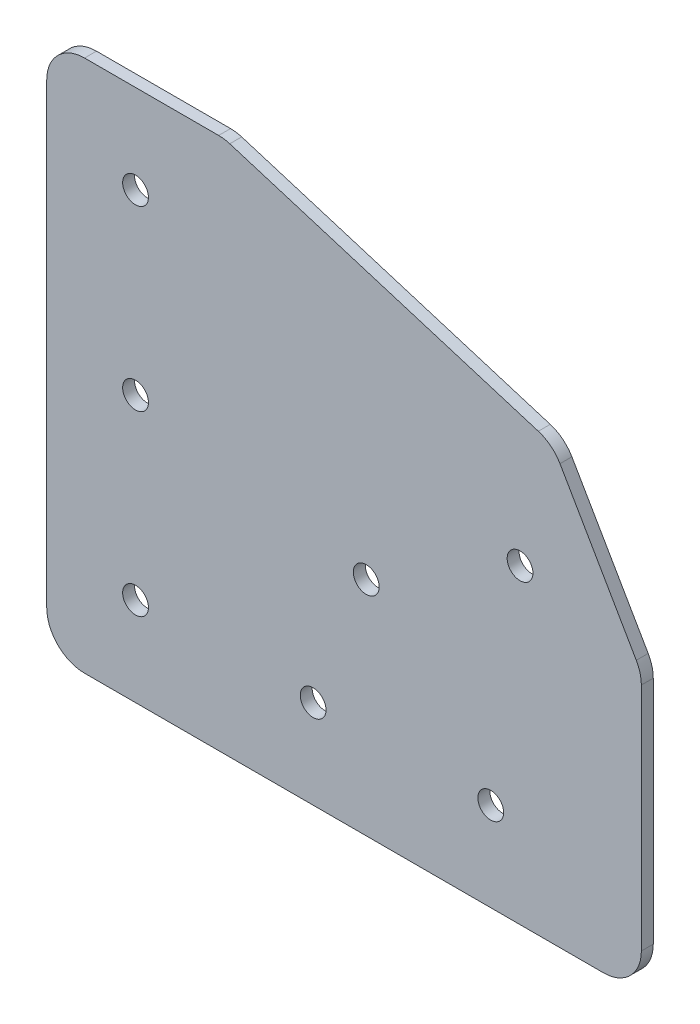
ISO-10303-21;
HEADER;
FILE_DESCRIPTION(('STEP AP214'),'2;1');
FILE_NAME('part.step','',(''),(''),'','','');
FILE_SCHEMA(('AUTOMOTIVE_DESIGN { 1 0 10303 214 1 1 1 1 }'));
ENDSEC;
DATA;
#1=APPLICATION_CONTEXT('core data for automotive mechanical design processes');
#2=APPLICATION_PROTOCOL_DEFINITION('international standard','automotive_design',2000,#1);
#3=PRODUCT_CONTEXT('',#1,'mechanical');
#4=PRODUCT('Part','Part','',(#3));
#5=PRODUCT_RELATED_PRODUCT_CATEGORY('part','',(#4));
#6=PRODUCT_DEFINITION_FORMATION('','',#4);
#7=PRODUCT_DEFINITION_CONTEXT('part definition',#1,'design');
#8=PRODUCT_DEFINITION('design','',#6,#7);
#9=PRODUCT_DEFINITION_SHAPE('','',#8);
#10=(LENGTH_UNIT() NAMED_UNIT(*) SI_UNIT(.MILLI.,.METRE.));
#11=(NAMED_UNIT(*) PLANE_ANGLE_UNIT() SI_UNIT($,.RADIAN.));
#12=(NAMED_UNIT(*) SI_UNIT($,.STERADIAN.) SOLID_ANGLE_UNIT());
#13=UNCERTAINTY_MEASURE_WITH_UNIT(LENGTH_MEASURE(1.E-05),#10,'distance_accuracy_value','');
#14=(GEOMETRIC_REPRESENTATION_CONTEXT(3) GLOBAL_UNCERTAINTY_ASSIGNED_CONTEXT((#13)) GLOBAL_UNIT_ASSIGNED_CONTEXT((#10,
#11,#12)) REPRESENTATION_CONTEXT('',''));
#15=CARTESIAN_POINT('',(0.,0.,0.));
#16=DIRECTION('',(0.,0.,1.));
#17=DIRECTION('',(1.,0.,0.));
#18=AXIS2_PLACEMENT_3D('',#15,#16,#17);
#19=CARTESIAN_POINT('',(0.,0.,1.524));
#20=DIRECTION('',(0.,0.,1.));
#21=DIRECTION('',(1.,0.,0.));
#22=AXIS2_PLACEMENT_3D('',#19,#20,#21);
#23=PLANE('',#22);
#24=DIRECTION('',(1.,0.,0.));
#25=VECTOR('',#24,1.);
#26=CARTESIAN_POINT('',(0.,0.,1.524));
#27=LINE('',#26,#25);
#28=CARTESIAN_POINT('',(4.841875,0.,1.524));
#29=VERTEX_POINT('',#28);
#30=CARTESIAN_POINT('',(71.2699415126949,0.,1.524));
#31=VERTEX_POINT('',#30);
#32=EDGE_CURVE('E138',#29,#31,#27,.T.);
#33=ORIENTED_EDGE('',*,*,#32,.T.);
#34=CARTESIAN_POINT('',(71.2699415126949,4.841875,1.524));
#35=DIRECTION('',(0.,0.,-1.));
#36=DIRECTION('',(-1.,0.,0.));
#37=AXIS2_PLACEMENT_3D('',#34,#35,#36);
#38=CIRCLE('',#37,4.841875);
#39=CARTESIAN_POINT('',(76.1118165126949,4.841875,1.524));
#40=VERTEX_POINT('',#39);
#41=EDGE_CURVE('E140',#40,#31,#38,.T.);
#42=ORIENTED_EDGE('',*,*,#41,.F.);
#43=DIRECTION('',(0.,1.,0.));
#44=VECTOR('',#43,1.);
#45=CARTESIAN_POINT('',(76.1118165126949,35.6223222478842,1.524));
#46=LINE('',#45,#44);
#47=CARTESIAN_POINT('',(76.1118165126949,34.3249457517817,1.524));
#48=VERTEX_POINT('',#47);
#49=EDGE_CURVE('E134',#48,#40,#46,.F.);
#50=ORIENTED_EDGE('',*,*,#49,.F.);
#51=CARTESIAN_POINT('',(71.2699415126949,34.3249457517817,1.524));
#52=DIRECTION('',(0.,0.,1.));
#53=DIRECTION('',(1.,0.,0.));
#54=AXIS2_PLACEMENT_3D('',#51,#52,#53);
#55=CIRCLE('',#54,4.841875);
#56=CARTESIAN_POINT('',(75.4631282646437,36.7458832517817,1.524));
#57=VERTEX_POINT('',#56);
#58=EDGE_CURVE('E192',#57,#48,#55,.F.);
#59=ORIENTED_EDGE('',*,*,#58,.F.);
#60=DIRECTION('',(0.500000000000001,-0.866025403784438,0.));
#61=VECTOR('',#60,1.);
#62=CARTESIAN_POINT('',(76.1118165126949,35.6223222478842,1.524));
#63=LINE('',#62,#61);
#64=CARTESIAN_POINT('',(65.697584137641,53.6603018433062,1.524));
#65=VERTEX_POINT('',#64);
#66=EDGE_CURVE('E110',#57,#65,#63,.F.);
#67=ORIENTED_EDGE('',*,*,#66,.T.);
#68=CARTESIAN_POINT('',(61.5043973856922,51.2393643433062,1.524));
#69=DIRECTION('',(0.,0.,-1.));
#70=DIRECTION('',(-1.,0.,0.));
#71=AXIS2_PLACEMENT_3D('',#68,#69,#70);
#72=CIRCLE('',#71,4.841875);
#73=CARTESIAN_POINT('',(62.924544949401,55.8682880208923,1.524));
#74=VERTEX_POINT('',#73);
#75=EDGE_CURVE('E104',#74,#65,#72,.T.);
#76=ORIENTED_EDGE('',*,*,#75,.F.);
#77=DIRECTION('',(0.956018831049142,-0.293305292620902,0.));
#78=VECTOR('',#77,1.);
#79=CARTESIAN_POINT('',(64.7453165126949,55.3096777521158,1.524));
#80=LINE('',#79,#78);
#81=CARTESIAN_POINT('',(23.4271077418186,67.9860486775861,1.524));
#82=VERTEX_POINT('',#81);
#83=EDGE_CURVE('E108',#74,#82,#80,.F.);
#84=ORIENTED_EDGE('',*,*,#83,.T.);
#85=CARTESIAN_POINT('',(22.0069601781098,63.357125,1.524));
#86=DIRECTION('',(0.,0.,-1.));
#87=DIRECTION('',(-1.,0.,0.));
#88=AXIS2_PLACEMENT_3D('',#85,#86,#87);
#89=CIRCLE('',#88,4.841875);
#90=CARTESIAN_POINT('',(22.0069601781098,68.199,1.524));
#91=VERTEX_POINT('',#90);
#92=EDGE_CURVE('E123',#91,#82,#89,.T.);
#93=ORIENTED_EDGE('',*,*,#92,.F.);
#94=DIRECTION('',(1.,0.,0.));
#95=VECTOR('',#94,1.);
#96=CARTESIAN_POINT('',(22.733,68.199,1.524));
#97=LINE('',#96,#95);
#98=CARTESIAN_POINT('',(4.84187500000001,68.199,1.524));
#99=VERTEX_POINT('',#98);
#100=EDGE_CURVE('E147',#91,#99,#97,.F.);
#101=ORIENTED_EDGE('',*,*,#100,.T.);
#102=CARTESIAN_POINT('',(4.84187500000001,63.357125,1.524));
#103=DIRECTION('',(0.,0.,-1.));
#104=DIRECTION('',(-1.,0.,0.));
#105=AXIS2_PLACEMENT_3D('',#102,#103,#104);
#106=CIRCLE('',#105,4.841875);
#107=CARTESIAN_POINT('',(0.,63.357125,1.524));
#108=VERTEX_POINT('',#107);
#109=EDGE_CURVE('E149',#108,#99,#106,.T.);
#110=ORIENTED_EDGE('',*,*,#109,.F.);
#111=DIRECTION('',(0.,1.,0.));
#112=VECTOR('',#111,1.);
#113=CARTESIAN_POINT('',(0.,68.199,1.524));
#114=LINE('',#113,#112);
#115=CARTESIAN_POINT('',(0.,4.841875,1.524));
#116=VERTEX_POINT('',#115);
#117=EDGE_CURVE('E142',#108,#116,#114,.F.);
#118=ORIENTED_EDGE('',*,*,#117,.T.);
#119=CARTESIAN_POINT('',(4.841875,4.841875,1.524));
#120=DIRECTION('',(0.,0.,-1.));
#121=DIRECTION('',(-1.,0.,0.));
#122=AXIS2_PLACEMENT_3D('',#119,#120,#121);
#123=CIRCLE('',#122,4.841875);
#124=EDGE_CURVE('E145',#29,#116,#123,.T.);
#125=ORIENTED_EDGE('',*,*,#124,.F.);
#126=EDGE_LOOP('',(#33,#42,#50,#59,#67,#76,#84,#93,#101,#110,#118,#125));
#127=FACE_BOUND('',#126,.T.);
#128=CARTESIAN_POINT('',(11.3665,56.8325,1.524));
#129=DIRECTION('',(0.,0.,1.));
#130=DIRECTION('',(1.,0.,0.));
#131=AXIS2_PLACEMENT_3D('',#128,#129,#130);
#132=CIRCLE('',#131,1.651);
#133=CARTESIAN_POINT('',(13.0175,56.8325,1.524));
#134=VERTEX_POINT('',#133);
#135=EDGE_CURVE('E116',#134,#134,#132,.F.);
#136=ORIENTED_EDGE('',*,*,#135,.T.);
#137=EDGE_LOOP('',(#136));
#138=FACE_BOUND('',#137,.T.);
#139=CARTESIAN_POINT('',(11.3665,34.0995,1.524));
#140=DIRECTION('',(0.,0.,1.));
#141=DIRECTION('',(1.,0.,0.));
#142=AXIS2_PLACEMENT_3D('',#139,#140,#141);
#143=CIRCLE('',#142,1.651);
#144=CARTESIAN_POINT('',(13.0175,34.0995,1.524));
#145=VERTEX_POINT('',#144);
#146=EDGE_CURVE('E203',#145,#145,#143,.F.);
#147=ORIENTED_EDGE('',*,*,#146,.T.);
#148=EDGE_LOOP('',(#147));
#149=FACE_BOUND('',#148,.T.);
#150=CARTESIAN_POINT('',(11.3665,11.3665,1.524));
#151=DIRECTION('',(0.,0.,1.));
#152=DIRECTION('',(1.,0.,0.));
#153=AXIS2_PLACEMENT_3D('',#150,#151,#152);
#154=CIRCLE('',#153,1.651);
#155=CARTESIAN_POINT('',(13.0175,11.3665,1.524));
#156=VERTEX_POINT('',#155);
#157=EDGE_CURVE('E206',#156,#156,#154,.F.);
#158=ORIENTED_EDGE('',*,*,#157,.T.);
#159=EDGE_LOOP('',(#158));
#160=FACE_BOUND('',#159,.T.);
#161=CARTESIAN_POINT('',(56.8325,11.3665,1.524));
#162=DIRECTION('',(0.,0.,1.));
#163=DIRECTION('',(1.,0.,0.));
#164=AXIS2_PLACEMENT_3D('',#161,#162,#163);
#165=CIRCLE('',#164,1.651);
#166=CARTESIAN_POINT('',(58.4835,11.3665,1.524));
#167=VERTEX_POINT('',#166);
#168=EDGE_CURVE('E209',#167,#167,#165,.F.);
#169=ORIENTED_EDGE('',*,*,#168,.T.);
#170=EDGE_LOOP('',(#169));
#171=FACE_BOUND('',#170,.T.);
#172=CARTESIAN_POINT('',(40.8975332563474,28.41625,1.524));
#173=DIRECTION('',(0.,0.,1.));
#174=DIRECTION('',(1.,0.,0.));
#175=AXIS2_PLACEMENT_3D('',#172,#173,#174);
#176=CIRCLE('',#175,1.651);
#177=CARTESIAN_POINT('',(42.5485332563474,28.41625,1.524));
#178=VERTEX_POINT('',#177);
#179=EDGE_CURVE('E212',#178,#178,#176,.F.);
#180=ORIENTED_EDGE('',*,*,#179,.T.);
#181=EDGE_LOOP('',(#180));
#182=FACE_BOUND('',#181,.T.);
#183=CARTESIAN_POINT('',(60.5848887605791,39.78275,1.524));
#184=DIRECTION('',(0.,0.,1.));
#185=DIRECTION('',(1.,0.,0.));
#186=AXIS2_PLACEMENT_3D('',#183,#184,#185);
#187=CIRCLE('',#186,1.651);
#188=CARTESIAN_POINT('',(62.2358887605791,39.78275,1.524));
#189=VERTEX_POINT('',#188);
#190=EDGE_CURVE('E214',#189,#189,#187,.F.);
#191=ORIENTED_EDGE('',*,*,#190,.T.);
#192=EDGE_LOOP('',(#191));
#193=FACE_BOUND('',#192,.T.);
#194=CARTESIAN_POINT('',(34.0995,11.3665,1.524));
#195=DIRECTION('',(0.,0.,1.));
#196=DIRECTION('',(1.,0.,0.));
#197=AXIS2_PLACEMENT_3D('',#194,#195,#196);
#198=CIRCLE('',#197,1.651);
#199=CARTESIAN_POINT('',(35.7505,11.3665,1.524));
#200=VERTEX_POINT('',#199);
#201=EDGE_CURVE('E20',#200,#200,#198,.F.);
#202=ORIENTED_EDGE('',*,*,#201,.T.);
#203=EDGE_LOOP('',(#202));
#204=FACE_BOUND('',#203,.T.);
#205=ADVANCED_FACE('F17',(#127,#138,#149,#160,#171,#182,#193,#204),#23,.T.);
#206=CARTESIAN_POINT('',(34.0995,11.3665,1.524));
#207=DIRECTION('',(0.,0.,1.));
#208=DIRECTION('',(1.,0.,0.));
#209=AXIS2_PLACEMENT_3D('',#206,#207,#208);
#210=CYLINDRICAL_SURFACE('',#209,1.651);
#211=CARTESIAN_POINT('',(34.0995,11.3665,0.));
#212=DIRECTION('',(0.,0.,1.));
#213=DIRECTION('',(1.,0.,0.));
#214=AXIS2_PLACEMENT_3D('',#211,#212,#213);
#215=CIRCLE('',#214,1.651);
#216=CARTESIAN_POINT('',(35.7505,11.3665,0.));
#217=VERTEX_POINT('',#216);
#218=EDGE_CURVE('E133',#217,#217,#215,.F.);
#219=ORIENTED_EDGE('',*,*,#218,.T.);
#220=EDGE_LOOP('',(#219));
#221=FACE_BOUND('',#220,.T.);
#222=ORIENTED_EDGE('',*,*,#201,.F.);
#223=EDGE_LOOP('',(#222));
#224=FACE_BOUND('',#223,.T.);
#225=ADVANCED_FACE('F222',(#221,#224),#210,.F.);
#226=CARTESIAN_POINT('',(60.5848887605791,39.78275,1.524));
#227=DIRECTION('',(0.,0.,1.));
#228=DIRECTION('',(1.,0.,0.));
#229=AXIS2_PLACEMENT_3D('',#226,#227,#228);
#230=CYLINDRICAL_SURFACE('',#229,1.651);
#231=CARTESIAN_POINT('',(60.5848887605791,39.78275,0.));
#232=DIRECTION('',(0.,0.,1.));
#233=DIRECTION('',(1.,0.,0.));
#234=AXIS2_PLACEMENT_3D('',#231,#232,#233);
#235=CIRCLE('',#234,1.651);
#236=CARTESIAN_POINT('',(62.2358887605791,39.78275,0.));
#237=VERTEX_POINT('',#236);
#238=EDGE_CURVE('E187',#237,#237,#235,.F.);
#239=ORIENTED_EDGE('',*,*,#238,.T.);
#240=EDGE_LOOP('',(#239));
#241=FACE_BOUND('',#240,.T.);
#242=ORIENTED_EDGE('',*,*,#190,.F.);
#243=EDGE_LOOP('',(#242));
#244=FACE_BOUND('',#243,.T.);
#245=ADVANCED_FACE('F224',(#241,#244),#230,.F.);
#246=CARTESIAN_POINT('',(40.8975332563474,28.41625,1.524));
#247=DIRECTION('',(0.,0.,1.));
#248=DIRECTION('',(1.,0.,0.));
#249=AXIS2_PLACEMENT_3D('',#246,#247,#248);
#250=CYLINDRICAL_SURFACE('',#249,1.651);
#251=CARTESIAN_POINT('',(40.8975332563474,28.41625,0.));
#252=DIRECTION('',(0.,0.,1.));
#253=DIRECTION('',(1.,0.,0.));
#254=AXIS2_PLACEMENT_3D('',#251,#252,#253);
#255=CIRCLE('',#254,1.651);
#256=CARTESIAN_POINT('',(42.5485332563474,28.41625,0.));
#257=VERTEX_POINT('',#256);
#258=EDGE_CURVE('E184',#257,#257,#255,.F.);
#259=ORIENTED_EDGE('',*,*,#258,.T.);
#260=EDGE_LOOP('',(#259));
#261=FACE_BOUND('',#260,.T.);
#262=ORIENTED_EDGE('',*,*,#179,.F.);
#263=EDGE_LOOP('',(#262));
#264=FACE_BOUND('',#263,.T.);
#265=ADVANCED_FACE('F231',(#261,#264),#250,.F.);
#266=CARTESIAN_POINT('',(56.8325,11.3665,1.524));
#267=DIRECTION('',(0.,0.,1.));
#268=DIRECTION('',(1.,0.,0.));
#269=AXIS2_PLACEMENT_3D('',#266,#267,#268);
#270=CYLINDRICAL_SURFACE('',#269,1.651);
#271=CARTESIAN_POINT('',(56.8325,11.3665,0.));
#272=DIRECTION('',(0.,0.,1.));
#273=DIRECTION('',(1.,0.,0.));
#274=AXIS2_PLACEMENT_3D('',#271,#272,#273);
#275=CIRCLE('',#274,1.651);
#276=CARTESIAN_POINT('',(58.4835,11.3665,0.));
#277=VERTEX_POINT('',#276);
#278=EDGE_CURVE('E181',#277,#277,#275,.F.);
#279=ORIENTED_EDGE('',*,*,#278,.T.);
#280=EDGE_LOOP('',(#279));
#281=FACE_BOUND('',#280,.T.);
#282=ORIENTED_EDGE('',*,*,#168,.F.);
#283=EDGE_LOOP('',(#282));
#284=FACE_BOUND('',#283,.T.);
#285=ADVANCED_FACE('F297',(#281,#284),#270,.F.);
#286=CARTESIAN_POINT('',(11.3665,11.3665,1.524));
#287=DIRECTION('',(0.,0.,1.));
#288=DIRECTION('',(1.,0.,0.));
#289=AXIS2_PLACEMENT_3D('',#286,#287,#288);
#290=CYLINDRICAL_SURFACE('',#289,1.651);
#291=CARTESIAN_POINT('',(11.3665,11.3665,0.));
#292=DIRECTION('',(0.,0.,1.));
#293=DIRECTION('',(1.,0.,0.));
#294=AXIS2_PLACEMENT_3D('',#291,#292,#293);
#295=CIRCLE('',#294,1.651);
#296=CARTESIAN_POINT('',(13.0175,11.3665,0.));
#297=VERTEX_POINT('',#296);
#298=EDGE_CURVE('E178',#297,#297,#295,.F.);
#299=ORIENTED_EDGE('',*,*,#298,.T.);
#300=EDGE_LOOP('',(#299));
#301=FACE_BOUND('',#300,.T.);
#302=ORIENTED_EDGE('',*,*,#157,.F.);
#303=EDGE_LOOP('',(#302));
#304=FACE_BOUND('',#303,.T.);
#305=ADVANCED_FACE('F293',(#301,#304),#290,.F.);
#306=CARTESIAN_POINT('',(11.3665,34.0995,1.524));
#307=DIRECTION('',(0.,0.,1.));
#308=DIRECTION('',(1.,0.,0.));
#309=AXIS2_PLACEMENT_3D('',#306,#307,#308);
#310=CYLINDRICAL_SURFACE('',#309,1.651);
#311=CARTESIAN_POINT('',(11.3665,34.0995,0.));
#312=DIRECTION('',(0.,0.,1.));
#313=DIRECTION('',(1.,0.,0.));
#314=AXIS2_PLACEMENT_3D('',#311,#312,#313);
#315=CIRCLE('',#314,1.651);
#316=CARTESIAN_POINT('',(13.0175,34.0995,0.));
#317=VERTEX_POINT('',#316);
#318=EDGE_CURVE('E175',#317,#317,#315,.F.);
#319=ORIENTED_EDGE('',*,*,#318,.T.);
#320=EDGE_LOOP('',(#319));
#321=FACE_BOUND('',#320,.T.);
#322=ORIENTED_EDGE('',*,*,#146,.F.);
#323=EDGE_LOOP('',(#322));
#324=FACE_BOUND('',#323,.T.);
#325=ADVANCED_FACE('F289',(#321,#324),#310,.F.);
#326=CARTESIAN_POINT('',(11.3665,56.8325,1.524));
#327=DIRECTION('',(0.,0.,1.));
#328=DIRECTION('',(1.,0.,0.));
#329=AXIS2_PLACEMENT_3D('',#326,#327,#328);
#330=CYLINDRICAL_SURFACE('',#329,1.651);
#331=CARTESIAN_POINT('',(11.3665,56.8325,0.));
#332=DIRECTION('',(0.,0.,1.));
#333=DIRECTION('',(1.,0.,0.));
#334=AXIS2_PLACEMENT_3D('',#331,#332,#333);
#335=CIRCLE('',#334,1.651);
#336=CARTESIAN_POINT('',(13.0175,56.8325,0.));
#337=VERTEX_POINT('',#336);
#338=EDGE_CURVE('E172',#337,#337,#335,.F.);
#339=ORIENTED_EDGE('',*,*,#338,.T.);
#340=EDGE_LOOP('',(#339));
#341=FACE_BOUND('',#340,.T.);
#342=ORIENTED_EDGE('',*,*,#135,.F.);
#343=EDGE_LOOP('',(#342));
#344=FACE_BOUND('',#343,.T.);
#345=ADVANCED_FACE('F286',(#341,#344),#330,.F.);
#346=CARTESIAN_POINT('',(61.5043973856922,51.2393643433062,1.524));
#347=DIRECTION('',(0.,0.,-1.));
#348=DIRECTION('',(-1.,0.,0.));
#349=AXIS2_PLACEMENT_3D('',#346,#347,#348);
#350=CYLINDRICAL_SURFACE('',#349,4.841875);
#351=CARTESIAN_POINT('',(61.5043973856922,51.2393643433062,0.));
#352=DIRECTION('',(0.,0.,-1.));
#353=DIRECTION('',(-1.,0.,0.));
#354=AXIS2_PLACEMENT_3D('',#351,#352,#353);
#355=CIRCLE('',#354,4.841875);
#356=CARTESIAN_POINT('',(65.697584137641,53.6603018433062,0.));
#357=VERTEX_POINT('',#356);
#358=CARTESIAN_POINT('',(62.924544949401,55.8682880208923,0.));
#359=VERTEX_POINT('',#358);
#360=EDGE_CURVE('E127',#357,#359,#355,.F.);
#361=ORIENTED_EDGE('',*,*,#360,.T.);
#362=DIRECTION('',(0.,0.,1.));
#363=VECTOR('',#362,1.);
#364=CARTESIAN_POINT('',(62.924544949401,55.8682880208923,1.524));
#365=LINE('',#364,#363);
#366=EDGE_CURVE('E115',#359,#74,#365,.T.);
#367=ORIENTED_EDGE('',*,*,#366,.T.);
#368=ORIENTED_EDGE('',*,*,#75,.T.);
#369=DIRECTION('',(0.,0.,1.));
#370=VECTOR('',#369,1.);
#371=CARTESIAN_POINT('',(65.697584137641,53.6603018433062,1.524));
#372=LINE('',#371,#370);
#373=EDGE_CURVE('E474',#65,#357,#372,.F.);
#374=ORIENTED_EDGE('',*,*,#373,.T.);
#375=EDGE_LOOP('',(#361,#367,#368,#374));
#376=FACE_BOUND('',#375,.T.);
#377=ADVANCED_FACE('F126',(#376),#350,.T.);
#378=CARTESIAN_POINT('',(64.7453165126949,55.3096777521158,1.524));
#379=DIRECTION('',(-0.293305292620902,-0.956018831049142,0.));
#380=DIRECTION('',(0.956018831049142,-0.293305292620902,0.));
#381=AXIS2_PLACEMENT_3D('',#378,#379,#380);
#382=PLANE('',#381);
#383=ORIENTED_EDGE('',*,*,#366,.F.);
#384=DIRECTION('',(-0.956018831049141,0.293305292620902,0.));
#385=VECTOR('',#384,1.);
#386=CARTESIAN_POINT('',(62.924544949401,55.8682880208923,0.));
#387=LINE('',#386,#385);
#388=CARTESIAN_POINT('',(23.4271077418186,67.9860486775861,0.));
#389=VERTEX_POINT('',#388);
#390=EDGE_CURVE('E170',#359,#389,#387,.T.);
#391=ORIENTED_EDGE('',*,*,#390,.T.);
#392=DIRECTION('',(0.,0.,-1.));
#393=VECTOR('',#392,1.);
#394=CARTESIAN_POINT('',(23.4271077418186,67.9860486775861,1.524));
#395=LINE('',#394,#393);
#396=EDGE_CURVE('E122',#82,#389,#395,.T.);
#397=ORIENTED_EDGE('',*,*,#396,.F.);
#398=ORIENTED_EDGE('',*,*,#83,.F.);
#399=EDGE_LOOP('',(#383,#391,#397,#398));
#400=FACE_BOUND('',#399,.T.);
#401=ADVANCED_FACE('F119',(#400),#382,.F.);
#402=CARTESIAN_POINT('',(22.0069601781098,63.357125,1.524));
#403=DIRECTION('',(0.,0.,-1.));
#404=DIRECTION('',(-1.,0.,0.));
#405=AXIS2_PLACEMENT_3D('',#402,#403,#404);
#406=CYLINDRICAL_SURFACE('',#405,4.841875);
#407=CARTESIAN_POINT('',(22.0069601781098,63.357125,0.));
#408=DIRECTION('',(0.,0.,-1.));
#409=DIRECTION('',(-1.,0.,0.));
#410=AXIS2_PLACEMENT_3D('',#407,#408,#409);
#411=CIRCLE('',#410,4.841875);
#412=CARTESIAN_POINT('',(22.0069601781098,68.199,0.));
#413=VERTEX_POINT('',#412);
#414=EDGE_CURVE('E167',#389,#413,#411,.F.);
#415=ORIENTED_EDGE('',*,*,#414,.T.);
#416=DIRECTION('',(0.,0.,-1.));
#417=VECTOR('',#416,1.);
#418=CARTESIAN_POINT('',(22.0069601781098,68.199,1.524));
#419=LINE('',#418,#417);
#420=EDGE_CURVE('E150',#413,#91,#419,.F.);
#421=ORIENTED_EDGE('',*,*,#420,.T.);
#422=ORIENTED_EDGE('',*,*,#92,.T.);
#423=ORIENTED_EDGE('',*,*,#396,.T.);
#424=EDGE_LOOP('',(#415,#421,#422,#423));
#425=FACE_BOUND('',#424,.T.);
#426=ADVANCED_FACE('F277',(#425),#406,.T.);
#427=CARTESIAN_POINT('',(22.733,68.199,1.524));
#428=DIRECTION('',(0.,-1.,0.));
#429=DIRECTION('',(0.,0.,-1.));
#430=AXIS2_PLACEMENT_3D('',#427,#428,#429);
#431=PLANE('',#430);
#432=ORIENTED_EDGE('',*,*,#420,.F.);
#433=DIRECTION('',(1.,0.,0.));
#434=VECTOR('',#433,1.);
#435=CARTESIAN_POINT('',(0.,68.199,0.));
#436=LINE('',#435,#434);
#437=CARTESIAN_POINT('',(4.84187500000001,68.199,0.));
#438=VERTEX_POINT('',#437);
#439=EDGE_CURVE('E166',#413,#438,#436,.F.);
#440=ORIENTED_EDGE('',*,*,#439,.T.);
#441=DIRECTION('',(0.,0.,-1.));
#442=VECTOR('',#441,1.);
#443=CARTESIAN_POINT('',(4.84187500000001,68.199,1.524));
#444=LINE('',#443,#442);
#445=EDGE_CURVE('E199',#99,#438,#444,.T.);
#446=ORIENTED_EDGE('',*,*,#445,.F.);
#447=ORIENTED_EDGE('',*,*,#100,.F.);
#448=EDGE_LOOP('',(#432,#440,#446,#447));
#449=FACE_BOUND('',#448,.T.);
#450=ADVANCED_FACE('F273',(#449),#431,.F.);
#451=CARTESIAN_POINT('',(4.84187500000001,63.357125,1.524));
#452=DIRECTION('',(0.,0.,-1.));
#453=DIRECTION('',(-1.,0.,0.));
#454=AXIS2_PLACEMENT_3D('',#451,#452,#453);
#455=CYLINDRICAL_SURFACE('',#454,4.841875);
#456=CARTESIAN_POINT('',(4.84187500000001,63.357125,0.));
#457=DIRECTION('',(0.,0.,-1.));
#458=DIRECTION('',(-1.,0.,0.));
#459=AXIS2_PLACEMENT_3D('',#456,#457,#458);
#460=CIRCLE('',#459,4.841875);
#461=CARTESIAN_POINT('',(0.,63.357125,0.));
#462=VERTEX_POINT('',#461);
#463=EDGE_CURVE('E163',#438,#462,#460,.F.);
#464=ORIENTED_EDGE('',*,*,#463,.T.);
#465=DIRECTION('',(0.,0.,1.));
#466=VECTOR('',#465,1.);
#467=CARTESIAN_POINT('',(0.,63.357125,1.524));
#468=LINE('',#467,#466);
#469=EDGE_CURVE('E146',#462,#108,#468,.T.);
#470=ORIENTED_EDGE('',*,*,#469,.T.);
#471=ORIENTED_EDGE('',*,*,#109,.T.);
#472=ORIENTED_EDGE('',*,*,#445,.T.);
#473=EDGE_LOOP('',(#464,#470,#471,#472));
#474=FACE_BOUND('',#473,.T.);
#475=ADVANCED_FACE('F269',(#474),#455,.T.);
#476=CARTESIAN_POINT('',(0.,68.199,1.524));
#477=DIRECTION('',(1.,0.,0.));
#478=DIRECTION('',(0.,1.,0.));
#479=AXIS2_PLACEMENT_3D('',#476,#477,#478);
#480=PLANE('',#479);
#481=DIRECTION('',(0.,0.,-1.));
#482=VECTOR('',#481,1.);
#483=CARTESIAN_POINT('',(0.,4.841875,1.524));
#484=LINE('',#483,#482);
#485=CARTESIAN_POINT('',(0.,4.841875,0.));
#486=VERTEX_POINT('',#485);
#487=EDGE_CURVE('E197',#116,#486,#484,.T.);
#488=ORIENTED_EDGE('',*,*,#487,.F.);
#489=ORIENTED_EDGE('',*,*,#117,.F.);
#490=ORIENTED_EDGE('',*,*,#469,.F.);
#491=DIRECTION('',(0.,1.,0.));
#492=VECTOR('',#491,1.);
#493=CARTESIAN_POINT('',(0.,0.,0.));
#494=LINE('',#493,#492);
#495=EDGE_CURVE('E162',#462,#486,#494,.F.);
#496=ORIENTED_EDGE('',*,*,#495,.T.);
#497=EDGE_LOOP('',(#488,#489,#490,#496));
#498=FACE_BOUND('',#497,.T.);
#499=ADVANCED_FACE('F265',(#498),#480,.F.);
#500=CARTESIAN_POINT('',(4.841875,4.841875,1.524));
#501=DIRECTION('',(0.,0.,-1.));
#502=DIRECTION('',(-1.,0.,0.));
#503=AXIS2_PLACEMENT_3D('',#500,#501,#502);
#504=CYLINDRICAL_SURFACE('',#503,4.841875);
#505=CARTESIAN_POINT('',(4.841875,4.841875,0.));
#506=DIRECTION('',(0.,0.,-1.));
#507=DIRECTION('',(-1.,0.,0.));
#508=AXIS2_PLACEMENT_3D('',#505,#506,#507);
#509=CIRCLE('',#508,4.841875);
#510=CARTESIAN_POINT('',(4.841875,0.,0.));
#511=VERTEX_POINT('',#510);
#512=EDGE_CURVE('E159',#486,#511,#509,.F.);
#513=ORIENTED_EDGE('',*,*,#512,.T.);
#514=DIRECTION('',(0.,0.,1.));
#515=VECTOR('',#514,1.);
#516=CARTESIAN_POINT('',(4.841875,0.,1.524));
#517=LINE('',#516,#515);
#518=EDGE_CURVE('E141',#511,#29,#517,.T.);
#519=ORIENTED_EDGE('',*,*,#518,.T.);
#520=ORIENTED_EDGE('',*,*,#124,.T.);
#521=ORIENTED_EDGE('',*,*,#487,.T.);
#522=EDGE_LOOP('',(#513,#519,#520,#521));
#523=FACE_BOUND('',#522,.T.);
#524=ADVANCED_FACE('F261',(#523),#504,.T.);
#525=CARTESIAN_POINT('',(0.,0.,1.524));
#526=DIRECTION('',(0.,1.,0.));
#527=DIRECTION('',(0.,0.,1.));
#528=AXIS2_PLACEMENT_3D('',#525,#526,#527);
#529=PLANE('',#528);
#530=DIRECTION('',(0.,0.,-1.));
#531=VECTOR('',#530,1.);
#532=CARTESIAN_POINT('',(71.2699415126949,0.,1.524));
#533=LINE('',#532,#531);
#534=CARTESIAN_POINT('',(71.2699415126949,0.,0.));
#535=VERTEX_POINT('',#534);
#536=EDGE_CURVE('E137',#31,#535,#533,.T.);
#537=ORIENTED_EDGE('',*,*,#536,.F.);
#538=ORIENTED_EDGE('',*,*,#32,.F.);
#539=ORIENTED_EDGE('',*,*,#518,.F.);
#540=DIRECTION('',(1.,0.,0.));
#541=VECTOR('',#540,1.);
#542=CARTESIAN_POINT('',(0.,0.,0.));
#543=LINE('',#542,#541);
#544=EDGE_CURVE('E158',#511,#535,#543,.T.);
#545=ORIENTED_EDGE('',*,*,#544,.T.);
#546=EDGE_LOOP('',(#537,#538,#539,#545));
#547=FACE_BOUND('',#546,.T.);
#548=ADVANCED_FACE('F257',(#547),#529,.F.);
#549=CARTESIAN_POINT('',(71.2699415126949,4.841875,1.524));
#550=DIRECTION('',(0.,0.,-1.));
#551=DIRECTION('',(-1.,0.,0.));
#552=AXIS2_PLACEMENT_3D('',#549,#550,#551);
#553=CYLINDRICAL_SURFACE('',#552,4.841875);
#554=ORIENTED_EDGE('',*,*,#41,.T.);
#555=ORIENTED_EDGE('',*,*,#536,.T.);
#556=CARTESIAN_POINT('',(71.2699415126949,4.841875,0.));
#557=DIRECTION('',(0.,0.,-1.));
#558=DIRECTION('',(-1.,0.,0.));
#559=AXIS2_PLACEMENT_3D('',#556,#557,#558);
#560=CIRCLE('',#559,4.841875);
#561=CARTESIAN_POINT('',(76.1118165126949,4.841875,0.));
#562=VERTEX_POINT('',#561);
#563=EDGE_CURVE('E155',#535,#562,#560,.F.);
#564=ORIENTED_EDGE('',*,*,#563,.T.);
#565=DIRECTION('',(0.,0.,-1.));
#566=VECTOR('',#565,1.);
#567=CARTESIAN_POINT('',(76.1118165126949,4.841875,-36.4905810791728));
#568=LINE('',#567,#566);
#569=EDGE_CURVE('E136',#40,#562,#568,.T.);
#570=ORIENTED_EDGE('',*,*,#569,.F.);
#571=EDGE_LOOP('',(#554,#555,#564,#570));
#572=FACE_BOUND('',#571,.T.);
#573=ADVANCED_FACE('F253',(#572),#553,.T.);
#574=CARTESIAN_POINT('',(76.1118165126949,35.6223222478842,-36.4905810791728));
#575=DIRECTION('',(1.,0.,0.));
#576=DIRECTION('',(0.,0.,-1.));
#577=AXIS2_PLACEMENT_3D('',#574,#575,#576);
#578=PLANE('',#577);
#579=ORIENTED_EDGE('',*,*,#49,.T.);
#580=ORIENTED_EDGE('',*,*,#569,.T.);
#581=DIRECTION('',(0.,1.,0.));
#582=VECTOR('',#581,1.);
#583=CARTESIAN_POINT('',(76.1118165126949,0.,0.));
#584=LINE('',#583,#582);
#585=CARTESIAN_POINT('',(76.1118165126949,34.3249457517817,0.));
#586=VERTEX_POINT('',#585);
#587=EDGE_CURVE('E154',#562,#586,#584,.T.);
#588=ORIENTED_EDGE('',*,*,#587,.T.);
#589=DIRECTION('',(0.,0.,1.));
#590=VECTOR('',#589,1.);
#591=CARTESIAN_POINT('',(76.1118165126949,34.3249457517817,1.524));
#592=LINE('',#591,#590);
#593=EDGE_CURVE('E194',#48,#586,#592,.F.);
#594=ORIENTED_EDGE('',*,*,#593,.F.);
#595=EDGE_LOOP('',(#579,#580,#588,#594));
#596=FACE_BOUND('',#595,.T.);
#597=ADVANCED_FACE('F249',(#596),#578,.T.);
#598=CARTESIAN_POINT('',(71.2699415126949,34.3249457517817,1.524));
#599=DIRECTION('',(0.,0.,1.));
#600=DIRECTION('',(1.,0.,0.));
#601=AXIS2_PLACEMENT_3D('',#598,#599,#600);
#602=CYLINDRICAL_SURFACE('',#601,4.841875);
#603=CARTESIAN_POINT('',(71.2699415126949,34.3249457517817,0.));
#604=DIRECTION('',(0.,0.,1.));
#605=DIRECTION('',(1.,0.,0.));
#606=AXIS2_PLACEMENT_3D('',#603,#604,#605);
#607=CIRCLE('',#606,4.841875);
#608=CARTESIAN_POINT('',(75.4631282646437,36.7458832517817,0.));
#609=VERTEX_POINT('',#608);
#610=EDGE_CURVE('E26',#586,#609,#607,.T.);
#611=ORIENTED_EDGE('',*,*,#610,.T.);
#612=DIRECTION('',(0.,0.,1.));
#613=VECTOR('',#612,1.);
#614=CARTESIAN_POINT('',(75.4631282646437,36.7458832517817,1.524));
#615=LINE('',#614,#613);
#616=EDGE_CURVE('E34',#609,#57,#615,.T.);
#617=ORIENTED_EDGE('',*,*,#616,.T.);
#618=ORIENTED_EDGE('',*,*,#58,.T.);
#619=ORIENTED_EDGE('',*,*,#593,.T.);
#620=EDGE_LOOP('',(#611,#617,#618,#619));
#621=FACE_BOUND('',#620,.T.);
#622=ADVANCED_FACE('F242',(#621),#602,.T.);
#623=CARTESIAN_POINT('',(76.1118165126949,35.6223222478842,1.524));
#624=DIRECTION('',(-0.866025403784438,-0.500000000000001,0.));
#625=DIRECTION('',(0.500000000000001,-0.866025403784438,0.));
#626=AXIS2_PLACEMENT_3D('',#623,#624,#625);
#627=PLANE('',#626);
#628=ORIENTED_EDGE('',*,*,#616,.F.);
#629=DIRECTION('',(-0.500000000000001,0.866025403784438,0.));
#630=VECTOR('',#629,1.);
#631=CARTESIAN_POINT('',(75.4631282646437,36.7458832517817,0.));
#632=LINE('',#631,#630);
#633=EDGE_CURVE('E10',#609,#357,#632,.T.);
#634=ORIENTED_EDGE('',*,*,#633,.T.);
#635=ORIENTED_EDGE('',*,*,#373,.F.);
#636=ORIENTED_EDGE('',*,*,#66,.F.);
#637=EDGE_LOOP('',(#628,#634,#635,#636));
#638=FACE_BOUND('',#637,.T.);
#639=ADVANCED_FACE('F236',(#638),#627,.F.);
#640=CARTESIAN_POINT('',(0.,0.,0.));
#641=DIRECTION('',(0.,0.,1.));
#642=DIRECTION('',(1.,0.,0.));
#643=AXIS2_PLACEMENT_3D('',#640,#641,#642);
#644=PLANE('',#643);
#645=ORIENTED_EDGE('',*,*,#610,.F.);
#646=ORIENTED_EDGE('',*,*,#587,.F.);
#647=ORIENTED_EDGE('',*,*,#563,.F.);
#648=ORIENTED_EDGE('',*,*,#544,.F.);
#649=ORIENTED_EDGE('',*,*,#512,.F.);
#650=ORIENTED_EDGE('',*,*,#495,.F.);
#651=ORIENTED_EDGE('',*,*,#463,.F.);
#652=ORIENTED_EDGE('',*,*,#439,.F.);
#653=ORIENTED_EDGE('',*,*,#414,.F.);
#654=ORIENTED_EDGE('',*,*,#390,.F.);
#655=ORIENTED_EDGE('',*,*,#360,.F.);
#656=ORIENTED_EDGE('',*,*,#633,.F.);
#657=EDGE_LOOP('',(#645,#646,#647,#648,#649,#650,#651,#652,#653,#654,#655,#656));
#658=FACE_BOUND('',#657,.T.);
#659=ORIENTED_EDGE('',*,*,#338,.F.);
#660=EDGE_LOOP('',(#659));
#661=FACE_BOUND('',#660,.T.);
#662=ORIENTED_EDGE('',*,*,#318,.F.);
#663=EDGE_LOOP('',(#662));
#664=FACE_BOUND('',#663,.T.);
#665=ORIENTED_EDGE('',*,*,#298,.F.);
#666=EDGE_LOOP('',(#665));
#667=FACE_BOUND('',#666,.T.);
#668=ORIENTED_EDGE('',*,*,#278,.F.);
#669=EDGE_LOOP('',(#668));
#670=FACE_BOUND('',#669,.T.);
#671=ORIENTED_EDGE('',*,*,#258,.F.);
#672=EDGE_LOOP('',(#671));
#673=FACE_BOUND('',#672,.T.);
#674=ORIENTED_EDGE('',*,*,#238,.F.);
#675=EDGE_LOOP('',(#674));
#676=FACE_BOUND('',#675,.T.);
#677=ORIENTED_EDGE('',*,*,#218,.F.);
#678=EDGE_LOOP('',(#677));
#679=FACE_BOUND('',#678,.T.);
#680=ADVANCED_FACE('F234',(#658,#661,#664,#667,#670,#673,#676,#679),#644,.F.);
#681=CLOSED_SHELL('',(#205,#225,#245,#265,#285,#305,#325,#345,#377,#401,#426,#450,#475,#499,
#524,#548,#573,#597,#622,#639,#680));
#682=MANIFOLD_SOLID_BREP('B1',#681);
#683=ADVANCED_BREP_SHAPE_REPRESENTATION('',(#18,#682),#14);
#684=SHAPE_DEFINITION_REPRESENTATION(#9,#683);
ENDSEC;
END-ISO-10303-21;
